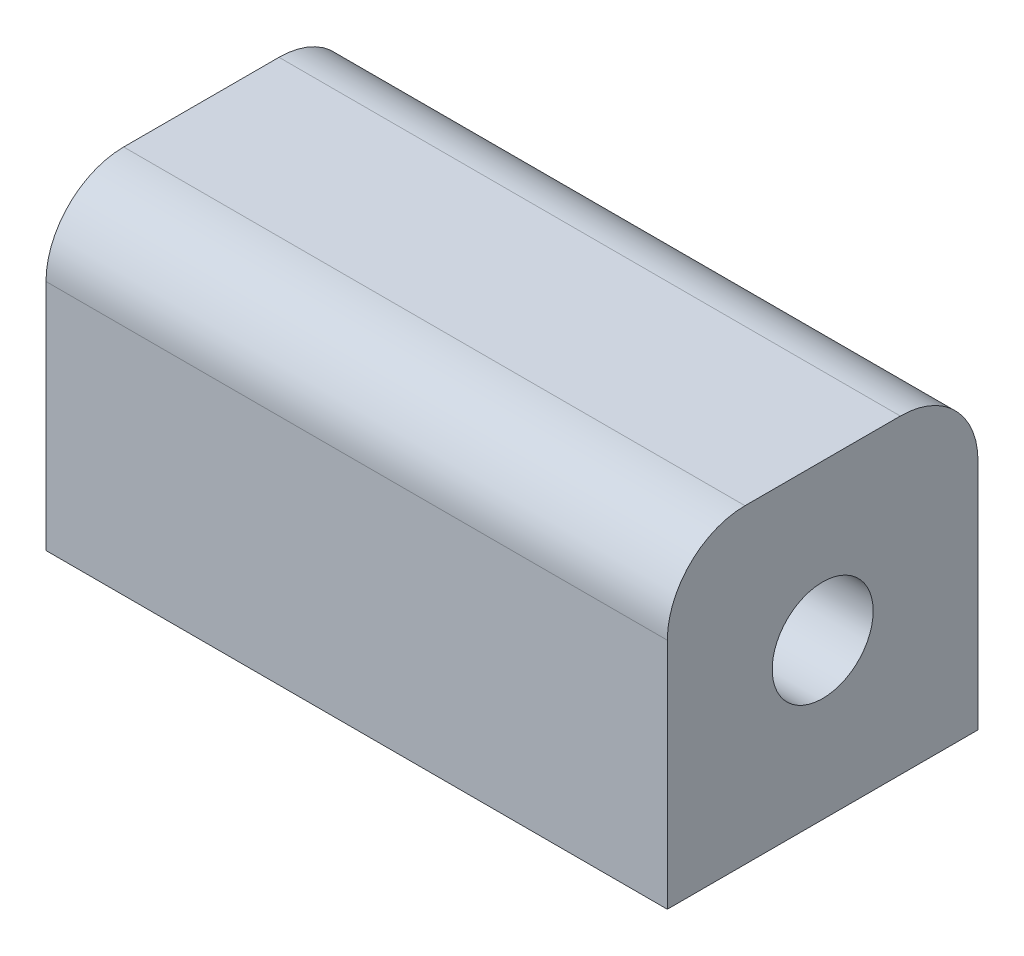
ISO-10303-21;
HEADER;
FILE_DESCRIPTION(('STEP AP214'),'2;1');
FILE_NAME('part.step','',(''),(''),'','','');
FILE_SCHEMA(('AUTOMOTIVE_DESIGN { 1 0 10303 214 1 1 1 1 }'));
ENDSEC;
DATA;
#1=APPLICATION_CONTEXT('core data for automotive mechanical design processes');
#2=APPLICATION_PROTOCOL_DEFINITION('international standard','automotive_design',2000,#1);
#3=PRODUCT_CONTEXT('',#1,'mechanical');
#4=PRODUCT('Part','Part','',(#3));
#5=PRODUCT_RELATED_PRODUCT_CATEGORY('part','',(#4));
#6=PRODUCT_DEFINITION_FORMATION('','',#4);
#7=PRODUCT_DEFINITION_CONTEXT('part definition',#1,'design');
#8=PRODUCT_DEFINITION('design','',#6,#7);
#9=PRODUCT_DEFINITION_SHAPE('','',#8);
#10=(LENGTH_UNIT() NAMED_UNIT(*) SI_UNIT(.MILLI.,.METRE.));
#11=(NAMED_UNIT(*) PLANE_ANGLE_UNIT() SI_UNIT($,.RADIAN.));
#12=(NAMED_UNIT(*) SI_UNIT($,.STERADIAN.) SOLID_ANGLE_UNIT());
#13=UNCERTAINTY_MEASURE_WITH_UNIT(LENGTH_MEASURE(1.E-05),#10,'distance_accuracy_value','');
#14=(GEOMETRIC_REPRESENTATION_CONTEXT(3) GLOBAL_UNCERTAINTY_ASSIGNED_CONTEXT((#13)) GLOBAL_UNIT_ASSIGNED_CONTEXT((#10,
#11,#12)) REPRESENTATION_CONTEXT('',''));
#15=CARTESIAN_POINT('',(0.,0.,0.));
#16=DIRECTION('',(0.,0.,1.));
#17=DIRECTION('',(1.,0.,0.));
#18=AXIS2_PLACEMENT_3D('',#15,#16,#17);
#19=CARTESIAN_POINT('',(0.,20.,0.));
#20=DIRECTION('',(1.,0.,0.));
#21=DIRECTION('',(0.,0.,-1.));
#22=AXIS2_PLACEMENT_3D('',#19,#20,#21);
#23=PLANE('',#22);
#24=CARTESIAN_POINT('',(0.,10.,-10.));
#25=DIRECTION('',(1.,0.,0.));
#26=DIRECTION('',(0.,0.,-1.));
#27=AXIS2_PLACEMENT_3D('',#24,#25,#26);
#28=CIRCLE('',#27,3.25);
#29=CARTESIAN_POINT('',(0.,10.,-13.25));
#30=VERTEX_POINT('',#29);
#31=EDGE_CURVE('E109',#30,#30,#28,.T.);
#32=ORIENTED_EDGE('',*,*,#31,.T.);
#33=EDGE_LOOP('',(#32));
#34=FACE_BOUND('',#33,.T.);
#35=DIRECTION('',(0.,0.,1.));
#36=VECTOR('',#35,1.);
#37=CARTESIAN_POINT('',(0.,20.,0.));
#38=LINE('',#37,#36);
#39=CARTESIAN_POINT('',(0.,20.,-15.));
#40=VERTEX_POINT('',#39);
#41=CARTESIAN_POINT('',(0.,20.,-5.));
#42=VERTEX_POINT('',#41);
#43=EDGE_CURVE('E121',#40,#42,#38,.T.);
#44=ORIENTED_EDGE('',*,*,#43,.F.);
#45=CARTESIAN_POINT('',(0.,15.,-15.));
#46=DIRECTION('',(1.,0.,0.));
#47=DIRECTION('',(0.,0.,-1.));
#48=AXIS2_PLACEMENT_3D('',#45,#46,#47);
#49=CIRCLE('',#48,5.);
#50=CARTESIAN_POINT('',(0.,15.,-20.));
#51=VERTEX_POINT('',#50);
#52=EDGE_CURVE('E188',#40,#51,#49,.F.);
#53=ORIENTED_EDGE('',*,*,#52,.T.);
#54=DIRECTION('',(0.,-1.,0.));
#55=VECTOR('',#54,1.);
#56=CARTESIAN_POINT('',(0.,20.,-20.));
#57=LINE('',#56,#55);
#58=CARTESIAN_POINT('',(0.,0.,-20.));
#59=VERTEX_POINT('',#58);
#60=EDGE_CURVE('E107',#51,#59,#57,.T.);
#61=ORIENTED_EDGE('',*,*,#60,.T.);
#62=DIRECTION('',(0.,0.,1.));
#63=VECTOR('',#62,1.);
#64=CARTESIAN_POINT('',(0.,0.,0.));
#65=LINE('',#64,#63);
#66=CARTESIAN_POINT('',(0.,0.,0.));
#67=VERTEX_POINT('',#66);
#68=EDGE_CURVE('E102',#59,#67,#65,.T.);
#69=ORIENTED_EDGE('',*,*,#68,.T.);
#70=DIRECTION('',(0.,-1.,0.));
#71=VECTOR('',#70,1.);
#72=CARTESIAN_POINT('',(0.,20.,0.));
#73=LINE('',#72,#71);
#74=CARTESIAN_POINT('',(0.,15.,0.));
#75=VERTEX_POINT('',#74);
#76=EDGE_CURVE('E86',#75,#67,#73,.T.);
#77=ORIENTED_EDGE('',*,*,#76,.F.);
#78=CARTESIAN_POINT('',(0.,15.,-5.));
#79=DIRECTION('',(1.,0.,0.));
#80=DIRECTION('',(0.,0.,-1.));
#81=AXIS2_PLACEMENT_3D('',#78,#79,#80);
#82=CIRCLE('',#81,5.);
#83=EDGE_CURVE('E189',#75,#42,#82,.F.);
#84=ORIENTED_EDGE('',*,*,#83,.T.);
#85=EDGE_LOOP('',(#44,#53,#61,#69,#77,#84));
#86=FACE_BOUND('',#85,.T.);
#87=ADVANCED_FACE('F33',(#34,#86),#23,.F.);
#88=CARTESIAN_POINT('',(0.,20.,0.));
#89=DIRECTION('',(0.,0.,-1.));
#90=DIRECTION('',(-1.,0.,0.));
#91=AXIS2_PLACEMENT_3D('',#88,#89,#90);
#92=PLANE('',#91);
#93=DIRECTION('',(0.,-1.,0.));
#94=VECTOR('',#93,1.);
#95=CARTESIAN_POINT('',(40.,20.,0.));
#96=LINE('',#95,#94);
#97=CARTESIAN_POINT('',(40.,15.,0.));
#98=VERTEX_POINT('',#97);
#99=CARTESIAN_POINT('',(40.,0.,0.));
#100=VERTEX_POINT('',#99);
#101=EDGE_CURVE('E96',#98,#100,#96,.T.);
#102=ORIENTED_EDGE('',*,*,#101,.F.);
#103=DIRECTION('',(1.,0.,0.));
#104=VECTOR('',#103,1.);
#105=CARTESIAN_POINT('',(0.,15.,0.));
#106=LINE('',#105,#104);
#107=EDGE_CURVE('E11',#98,#75,#106,.F.);
#108=ORIENTED_EDGE('',*,*,#107,.T.);
#109=ORIENTED_EDGE('',*,*,#76,.T.);
#110=DIRECTION('',(1.,0.,0.));
#111=VECTOR('',#110,1.);
#112=CARTESIAN_POINT('',(0.,0.,0.));
#113=LINE('',#112,#111);
#114=EDGE_CURVE('E89',#67,#100,#113,.T.);
#115=ORIENTED_EDGE('',*,*,#114,.T.);
#116=EDGE_LOOP('',(#102,#108,#109,#115));
#117=FACE_BOUND('',#116,.T.);
#118=ADVANCED_FACE('F88',(#117),#92,.F.);
#119=CARTESIAN_POINT('',(40.,20.,0.));
#120=DIRECTION('',(-1.,0.,0.));
#121=DIRECTION('',(0.,0.,1.));
#122=AXIS2_PLACEMENT_3D('',#119,#120,#121);
#123=PLANE('',#122);
#124=CARTESIAN_POINT('',(40.,10.,-10.));
#125=DIRECTION('',(1.,0.,0.));
#126=DIRECTION('',(0.,0.,-1.));
#127=AXIS2_PLACEMENT_3D('',#124,#125,#126);
#128=CIRCLE('',#127,3.25);
#129=CARTESIAN_POINT('',(40.,10.,-13.25));
#130=VERTEX_POINT('',#129);
#131=EDGE_CURVE('E112',#130,#130,#128,.T.);
#132=ORIENTED_EDGE('',*,*,#131,.F.);
#133=EDGE_LOOP('',(#132));
#134=FACE_BOUND('',#133,.T.);
#135=DIRECTION('',(0.,-1.,0.));
#136=VECTOR('',#135,1.);
#137=CARTESIAN_POINT('',(40.,20.,-20.));
#138=LINE('',#137,#136);
#139=CARTESIAN_POINT('',(40.,15.,-20.));
#140=VERTEX_POINT('',#139);
#141=CARTESIAN_POINT('',(40.,0.,-20.));
#142=VERTEX_POINT('',#141);
#143=EDGE_CURVE('E123',#140,#142,#138,.T.);
#144=ORIENTED_EDGE('',*,*,#143,.F.);
#145=CARTESIAN_POINT('',(40.,15.,-15.));
#146=DIRECTION('',(-1.,0.,0.));
#147=DIRECTION('',(0.,0.,1.));
#148=AXIS2_PLACEMENT_3D('',#145,#146,#147);
#149=CIRCLE('',#148,5.);
#150=CARTESIAN_POINT('',(40.,20.,-15.));
#151=VERTEX_POINT('',#150);
#152=EDGE_CURVE('E41',#140,#151,#149,.F.);
#153=ORIENTED_EDGE('',*,*,#152,.T.);
#154=DIRECTION('',(0.,0.,-1.));
#155=VECTOR('',#154,1.);
#156=CARTESIAN_POINT('',(40.,20.,0.));
#157=LINE('',#156,#155);
#158=CARTESIAN_POINT('',(40.,20.,-5.));
#159=VERTEX_POINT('',#158);
#160=EDGE_CURVE('E115',#159,#151,#157,.T.);
#161=ORIENTED_EDGE('',*,*,#160,.F.);
#162=CARTESIAN_POINT('',(40.,15.,-5.));
#163=DIRECTION('',(-1.,0.,0.));
#164=DIRECTION('',(0.,0.,1.));
#165=AXIS2_PLACEMENT_3D('',#162,#163,#164);
#166=CIRCLE('',#165,5.);
#167=EDGE_CURVE('E48',#159,#98,#166,.F.);
#168=ORIENTED_EDGE('',*,*,#167,.T.);
#169=ORIENTED_EDGE('',*,*,#101,.T.);
#170=DIRECTION('',(0.,0.,-1.));
#171=VECTOR('',#170,1.);
#172=CARTESIAN_POINT('',(40.,0.,0.));
#173=LINE('',#172,#171);
#174=EDGE_CURVE('E104',#100,#142,#173,.T.);
#175=ORIENTED_EDGE('',*,*,#174,.T.);
#176=EDGE_LOOP('',(#144,#153,#161,#168,#169,#175));
#177=FACE_BOUND('',#176,.T.);
#178=ADVANCED_FACE('F163',(#134,#177),#123,.F.);
#179=CARTESIAN_POINT('',(0.,20.,-20.));
#180=DIRECTION('',(0.,0.,1.));
#181=DIRECTION('',(1.,0.,0.));
#182=AXIS2_PLACEMENT_3D('',#179,#180,#181);
#183=PLANE('',#182);
#184=ORIENTED_EDGE('',*,*,#60,.F.);
#185=DIRECTION('',(-1.,0.,0.));
#186=VECTOR('',#185,1.);
#187=CARTESIAN_POINT('',(0.,15.,-20.));
#188=LINE('',#187,#186);
#189=EDGE_CURVE('E56',#51,#140,#188,.F.);
#190=ORIENTED_EDGE('',*,*,#189,.T.);
#191=ORIENTED_EDGE('',*,*,#143,.T.);
#192=DIRECTION('',(-1.,0.,0.));
#193=VECTOR('',#192,1.);
#194=CARTESIAN_POINT('',(0.,0.,-20.));
#195=LINE('',#194,#193);
#196=EDGE_CURVE('E119',#142,#59,#195,.T.);
#197=ORIENTED_EDGE('',*,*,#196,.T.);
#198=EDGE_LOOP('',(#184,#190,#191,#197));
#199=FACE_BOUND('',#198,.T.);
#200=ADVANCED_FACE('F168',(#199),#183,.F.);
#201=CARTESIAN_POINT('',(0.,20.,-20.));
#202=DIRECTION('',(0.,-1.,0.));
#203=DIRECTION('',(0.,0.,-1.));
#204=AXIS2_PLACEMENT_3D('',#201,#202,#203);
#205=PLANE('',#204);
#206=ORIENTED_EDGE('',*,*,#160,.T.);
#207=DIRECTION('',(-1.,0.,0.));
#208=VECTOR('',#207,1.);
#209=CARTESIAN_POINT('',(0.,20.,-15.));
#210=LINE('',#209,#208);
#211=EDGE_CURVE('E185',#151,#40,#210,.T.);
#212=ORIENTED_EDGE('',*,*,#211,.T.);
#213=ORIENTED_EDGE('',*,*,#43,.T.);
#214=DIRECTION('',(1.,0.,0.));
#215=VECTOR('',#214,1.);
#216=CARTESIAN_POINT('',(0.,20.,-5.));
#217=LINE('',#216,#215);
#218=EDGE_CURVE('E95',#42,#159,#217,.T.);
#219=ORIENTED_EDGE('',*,*,#218,.T.);
#220=EDGE_LOOP('',(#206,#212,#213,#219));
#221=FACE_BOUND('',#220,.T.);
#222=ADVANCED_FACE('F172',(#221),#205,.F.);
#223=CARTESIAN_POINT('',(0.,0.,-20.));
#224=DIRECTION('',(0.,-1.,0.));
#225=DIRECTION('',(0.,0.,-1.));
#226=AXIS2_PLACEMENT_3D('',#223,#224,#225);
#227=PLANE('',#226);
#228=CARTESIAN_POINT('',(10.,0.,-10.));
#229=DIRECTION('',(0.,-1.,0.));
#230=DIRECTION('',(0.,0.,-1.));
#231=AXIS2_PLACEMENT_3D('',#228,#229,#230);
#232=CIRCLE('',#231,1.5);
#233=CARTESIAN_POINT('',(10.,0.,-11.5));
#234=VERTEX_POINT('',#233);
#235=EDGE_CURVE('E201',#234,#234,#232,.T.);
#236=ORIENTED_EDGE('',*,*,#235,.F.);
#237=EDGE_LOOP('',(#236));
#238=FACE_BOUND('',#237,.T.);
#239=CARTESIAN_POINT('',(30.,0.,-10.));
#240=DIRECTION('',(0.,-1.,0.));
#241=DIRECTION('',(0.,0.,-1.));
#242=AXIS2_PLACEMENT_3D('',#239,#240,#241);
#243=CIRCLE('',#242,1.5);
#244=CARTESIAN_POINT('',(30.,0.,-11.5));
#245=VERTEX_POINT('',#244);
#246=EDGE_CURVE('E133',#245,#245,#243,.T.);
#247=ORIENTED_EDGE('',*,*,#246,.F.);
#248=EDGE_LOOP('',(#247));
#249=FACE_BOUND('',#248,.T.);
#250=ORIENTED_EDGE('',*,*,#68,.F.);
#251=ORIENTED_EDGE('',*,*,#196,.F.);
#252=ORIENTED_EDGE('',*,*,#174,.F.);
#253=ORIENTED_EDGE('',*,*,#114,.F.);
#254=EDGE_LOOP('',(#250,#251,#252,#253));
#255=FACE_BOUND('',#254,.T.);
#256=ADVANCED_FACE('F100',(#238,#249,#255),#227,.T.);
#257=CARTESIAN_POINT('',(0.,10.,-10.));
#258=DIRECTION('',(1.,0.,0.));
#259=DIRECTION('',(0.,0.,-1.));
#260=AXIS2_PLACEMENT_3D('',#257,#258,#259);
#261=CYLINDRICAL_SURFACE('',#260,3.25);
#262=CARTESIAN_POINT('',(10.,7.1168593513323,-11.5));
#263=CARTESIAN_POINT('',(10.0790560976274,7.1168542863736,-11.4999955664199));
#264=CARTESIAN_POINT('',(10.1582321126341,7.11355984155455,-11.4937096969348));
#265=CARTESIAN_POINT('',(10.3142248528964,7.10083600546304,-11.4688541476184));
#266=CARTESIAN_POINT('',(10.3910354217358,7.09139182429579,-11.4502548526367));
#267=CARTESIAN_POINT('',(10.5397553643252,7.0676860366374,-11.4016968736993));
#268=CARTESIAN_POINT('',(10.6116859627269,7.05344714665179,-11.3717916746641));
#269=CARTESIAN_POINT('',(10.7494914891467,7.0217909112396,-11.3016323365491));
#270=CARTESIAN_POINT('',(10.8153669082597,7.00437382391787,-11.2613790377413));
#271=CARTESIAN_POINT('',(10.9442826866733,6.96683285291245,-11.1683661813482));
#272=CARTESIAN_POINT('',(11.0068049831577,6.9466049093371,-11.1149302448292));
#273=CARTESIAN_POINT('',(11.1223938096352,6.90656765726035,-10.9984822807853));
#274=CARTESIAN_POINT('',(11.1754561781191,6.88675853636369,-10.9354660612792));
#275=CARTESIAN_POINT('',(11.2734806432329,6.84847607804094,-10.7973722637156));
#276=CARTESIAN_POINT('',(11.3178315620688,6.83013743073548,-10.7218200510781));
#277=CARTESIAN_POINT('',(11.3929625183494,6.79817483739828,-10.5633240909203));
#278=CARTESIAN_POINT('',(11.4237498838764,6.78454834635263,-10.4803843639));
#279=CARTESIAN_POINT('',(11.4689131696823,6.76428913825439,-10.3149336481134));
#280=CARTESIAN_POINT('',(11.4841902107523,6.75727436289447,-10.2327164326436));
#281=CARTESIAN_POINT('',(11.5008399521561,6.74962121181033,-10.0666076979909));
#282=CARTESIAN_POINT('',(11.5022196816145,6.74897961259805,-9.98271704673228));
#283=CARTESIAN_POINT('',(11.4914440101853,6.7539424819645,-9.82230837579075));
#284=CARTESIAN_POINT('',(11.4802875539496,6.75908599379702,-9.74570603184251));
#285=CARTESIAN_POINT('',(11.446507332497,6.77437487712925,-9.59560459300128));
#286=CARTESIAN_POINT('',(11.4238827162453,6.78452061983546,-9.52210572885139));
#287=CARTESIAN_POINT('',(11.3675879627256,6.80905225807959,-9.37894346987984));
#288=CARTESIAN_POINT('',(11.3337570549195,6.82349954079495,-9.30935424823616));
#289=CARTESIAN_POINT('',(11.2561940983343,6.85527850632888,-9.17665994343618));
#290=CARTESIAN_POINT('',(11.2124584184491,6.87261124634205,-9.11355725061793));
#291=CARTESIAN_POINT('',(11.1121036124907,6.91018883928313,-8.99001134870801));
#292=CARTESIAN_POINT('',(11.054713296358,6.93055600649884,-8.9302310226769));
#293=CARTESIAN_POINT('',(10.9307885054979,6.97090175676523,-8.82081753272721));
#294=CARTESIAN_POINT('',(10.8642488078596,6.99088011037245,-8.77119020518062));
#295=CARTESIAN_POINT('',(10.7199693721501,7.02917527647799,-8.68120934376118));
#296=CARTESIAN_POINT('',(10.6418464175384,7.04736710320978,-8.64141216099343));
#297=CARTESIAN_POINT('',(10.4789558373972,7.07843527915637,-8.57581901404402));
#298=CARTESIAN_POINT('',(10.3941942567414,7.09131639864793,-8.55001047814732));
#299=CARTESIAN_POINT('',(10.2270781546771,7.10903378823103,-8.51501701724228));
#300=CARTESIAN_POINT('',(10.145008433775,7.1143940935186,-8.50474482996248));
#301=CARTESIAN_POINT('',(9.98016038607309,7.11796624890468,-8.49786751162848));
#302=CARTESIAN_POINT('',(9.89738243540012,7.11618168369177,-8.50125552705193));
#303=CARTESIAN_POINT('',(9.74103868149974,7.10621551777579,-8.52060592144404));
#304=CARTESIAN_POINT('',(9.66729423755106,7.09859909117,-8.53545825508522));
#305=CARTESIAN_POINT('',(9.52344336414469,7.0786089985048,-8.57575404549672));
#306=CARTESIAN_POINT('',(9.45333793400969,7.06623403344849,-8.60120039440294));
#307=CARTESIAN_POINT('',(9.31514231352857,7.03744245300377,-8.66322455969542));
#308=CARTESIAN_POINT('',(9.24729111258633,7.0208668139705,-8.70025843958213));
#309=CARTESIAN_POINT('',(9.11839921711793,6.98572279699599,-8.78398483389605));
#310=CARTESIAN_POINT('',(9.05736187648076,6.96715344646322,-8.83068207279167));
#311=CARTESIAN_POINT('',(8.93720338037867,6.92778829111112,-8.93810874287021));
#312=CARTESIAN_POINT('',(8.87894171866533,6.90696178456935,-8.99979245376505));
#313=CARTESIAN_POINT('',(8.77338164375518,6.86715790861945,-9.1324777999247));
#314=CARTESIAN_POINT('',(8.72608534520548,6.84818089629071,-9.20348122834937));
#315=CARTESIAN_POINT('',(8.64336785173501,6.8138560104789,-9.3542203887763));
#316=CARTESIAN_POINT('',(8.60811091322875,6.79855911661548,-9.43405863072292));
#317=CARTESIAN_POINT('',(8.55184202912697,6.77369887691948,-9.59943594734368));
#318=CARTESIAN_POINT('',(8.530819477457,6.76413126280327,-9.6849707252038));
#319=CARTESIAN_POINT('',(8.50516273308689,6.75239744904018,-9.85172583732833));
#320=CARTESIAN_POINT('',(8.49932421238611,6.74968783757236,-9.93272343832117));
#321=CARTESIAN_POINT('',(8.50079987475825,6.75036943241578,-10.0945622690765));
#322=CARTESIAN_POINT('',(8.50811070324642,6.75375908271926,-10.1754035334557));
#323=CARTESIAN_POINT('',(8.53482963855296,6.7659476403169,-10.3303771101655));
#324=CARTESIAN_POINT('',(8.55360863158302,6.77446493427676,-10.4046421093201));
#325=CARTESIAN_POINT('',(8.6019630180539,6.79585601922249,-10.5488920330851));
#326=CARTESIAN_POINT('',(8.63154019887,6.80873053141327,-10.6188762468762));
#327=CARTESIAN_POINT('',(8.702114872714,6.83836514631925,-10.7561207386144));
#328=CARTESIAN_POINT('',(8.7435711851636,6.85527552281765,-10.8231117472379));
#329=CARTESIAN_POINT('',(8.83611548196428,6.89109220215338,-10.9494805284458));
#330=CARTESIAN_POINT('',(8.88720775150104,6.90999939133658,-11.0088548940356));
#331=CARTESIAN_POINT('',(9.00267061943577,6.94975682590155,-11.1236157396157));
#332=CARTESIAN_POINT('',(9.06780238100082,6.97063516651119,-11.1782291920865));
#333=CARTESIAN_POINT('',(9.20680487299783,7.01047954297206,-11.275954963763));
#334=CARTESIAN_POINT('',(9.28068155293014,7.0294442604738,-11.3190593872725));
#335=CARTESIAN_POINT('',(9.43637377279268,7.0632766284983,-11.3927764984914));
#336=CARTESIAN_POINT('',(9.51826799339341,7.07809670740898,-11.4232459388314));
#337=CARTESIAN_POINT('',(9.68683680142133,7.1010908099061,-11.4695281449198));
#338=CARTESIAN_POINT('',(9.77349429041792,7.10928713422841,-11.4853901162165));
#339=CARTESIAN_POINT('',(9.88400857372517,7.11462113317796,-11.4956902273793));
#340=CARTESIAN_POINT('',(9.90716599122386,7.11545838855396,-11.4973045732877));
#341=CARTESIAN_POINT('',(9.95354548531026,7.11657825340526,-11.4994601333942));
#342=CARTESIAN_POINT('',(9.97676756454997,7.11686083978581,-11.5000013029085));
#343=CARTESIAN_POINT('',(10.,7.1168593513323,-11.5));
#344=B_SPLINE_CURVE_WITH_KNOTS('',3,(#262,#263,#264,#265,#266,#267,#268,#269,#270,#271,#272,
#273,#274,#275,#276,#277,#278,#279,#280,#281,#282,#283,#284,#285,#286,#287,#288,#289,#290,#291,
#292,#293,#294,#295,#296,#297,#298,#299,#300,#301,#302,#303,#304,#305,#306,#307,#308,#309,#310,
#311,#312,#313,#314,#315,#316,#317,#318,#319,#320,#321,#322,#323,#324,#325,#326,#327,#328,#329,
#330,#331,#332,#333,#334,#335,#336,#337,#338,#339,#340,#341,#342,#343),.UNSPECIFIED.,.T.,.F.,(4,
2,2,2,2,2,2,2,2,2,2,2,2,2,2,2,2,2,2,2,2,2,2,2,2,2,2,2,2,2,2,2,2,2,2,2,2,2,2,2,4),(0.,
0.237070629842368,0.474713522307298,0.71124598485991,0.947759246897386,1.20076595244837,
1.45388368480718,1.72101627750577,1.98800436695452,2.23839767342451,2.48866432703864,
2.72031924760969,2.95199136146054,3.18714254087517,3.42238006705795,3.67727504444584,
3.93231613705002,4.1995422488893,4.46652780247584,4.71378889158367,4.96092594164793,
5.18674173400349,5.41261921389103,5.64883211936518,5.8851607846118,6.14606812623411,
6.40702574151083,6.67141336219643,6.93560376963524,7.17809302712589,7.42052043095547,
7.65071362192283,7.88094493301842,8.1216630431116,8.36248845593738,8.62387073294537,
8.88543187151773,9.14988229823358,9.41343862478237,9.48310433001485,9.55277293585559),.UNSPECIFIED.);
#345=CARTESIAN_POINT('',(10.,7.1168593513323,-11.5));
#346=VERTEX_POINT('',#345);
#347=EDGE_CURVE('E134',#346,#346,#344,.T.);
#348=ORIENTED_EDGE('',*,*,#347,.T.);
#349=EDGE_LOOP('',(#348));
#350=FACE_BOUND('',#349,.T.);
#351=CARTESIAN_POINT('',(30.,7.1168593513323,-11.5));
#352=CARTESIAN_POINT('',(30.0790560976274,7.1168542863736,-11.4999955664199));
#353=CARTESIAN_POINT('',(30.1582321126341,7.11355984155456,-11.4937096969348));
#354=CARTESIAN_POINT('',(30.3142248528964,7.10083600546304,-11.4688541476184));
#355=CARTESIAN_POINT('',(30.3910354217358,7.09139182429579,-11.4502548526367));
#356=CARTESIAN_POINT('',(30.5397553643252,7.06768603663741,-11.4016968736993));
#357=CARTESIAN_POINT('',(30.6116859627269,7.05344714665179,-11.3717916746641));
#358=CARTESIAN_POINT('',(30.7494914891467,7.0217909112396,-11.3016323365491));
#359=CARTESIAN_POINT('',(30.8153669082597,7.00437382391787,-11.2613790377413));
#360=CARTESIAN_POINT('',(30.9442826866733,6.96683285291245,-11.1683661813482));
#361=CARTESIAN_POINT('',(31.0068049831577,6.9466049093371,-11.1149302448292));
#362=CARTESIAN_POINT('',(31.1223938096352,6.90656765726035,-10.9984822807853));
#363=CARTESIAN_POINT('',(31.1754561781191,6.88675853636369,-10.9354660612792));
#364=CARTESIAN_POINT('',(31.2734806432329,6.84847607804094,-10.7973722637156));
#365=CARTESIAN_POINT('',(31.3178315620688,6.83013743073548,-10.7218200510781));
#366=CARTESIAN_POINT('',(31.3929625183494,6.79817483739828,-10.5633240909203));
#367=CARTESIAN_POINT('',(31.4237498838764,6.78454834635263,-10.4803843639));
#368=CARTESIAN_POINT('',(31.4689131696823,6.76428913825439,-10.3149336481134));
#369=CARTESIAN_POINT('',(31.4841902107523,6.75727436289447,-10.2327164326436));
#370=CARTESIAN_POINT('',(31.5008399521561,6.74962121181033,-10.0666076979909));
#371=CARTESIAN_POINT('',(31.5022196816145,6.74897961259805,-9.98271704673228));
#372=CARTESIAN_POINT('',(31.4914440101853,6.7539424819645,-9.82230837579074));
#373=CARTESIAN_POINT('',(31.4802875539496,6.75908599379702,-9.74570603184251));
#374=CARTESIAN_POINT('',(31.446507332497,6.77437487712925,-9.59560459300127));
#375=CARTESIAN_POINT('',(31.4238827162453,6.78452061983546,-9.52210572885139));
#376=CARTESIAN_POINT('',(31.3675879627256,6.80905225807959,-9.37894346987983));
#377=CARTESIAN_POINT('',(31.3337570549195,6.82349954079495,-9.30935424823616));
#378=CARTESIAN_POINT('',(31.2561940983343,6.85527850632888,-9.17665994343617));
#379=CARTESIAN_POINT('',(31.2124584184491,6.87261124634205,-9.11355725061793));
#380=CARTESIAN_POINT('',(31.1121036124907,6.91018883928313,-8.99001134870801));
#381=CARTESIAN_POINT('',(31.054713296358,6.93055600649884,-8.9302310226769));
#382=CARTESIAN_POINT('',(30.9307885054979,6.97090175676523,-8.8208175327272));
#383=CARTESIAN_POINT('',(30.8642488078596,6.99088011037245,-8.77119020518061));
#384=CARTESIAN_POINT('',(30.7199693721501,7.029175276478,-8.68120934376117));
#385=CARTESIAN_POINT('',(30.6418464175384,7.04736710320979,-8.64141216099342));
#386=CARTESIAN_POINT('',(30.4789558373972,7.07843527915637,-8.57581901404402));
#387=CARTESIAN_POINT('',(30.3941942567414,7.09131639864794,-8.55001047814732));
#388=CARTESIAN_POINT('',(30.2270781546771,7.10903378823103,-8.51501701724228));
#389=CARTESIAN_POINT('',(30.145008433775,7.1143940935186,-8.50474482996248));
#390=CARTESIAN_POINT('',(29.9801603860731,7.11796624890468,-8.49786751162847));
#391=CARTESIAN_POINT('',(29.8973824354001,7.11618168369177,-8.50125552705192));
#392=CARTESIAN_POINT('',(29.7410386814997,7.10621551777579,-8.52060592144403));
#393=CARTESIAN_POINT('',(29.6672942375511,7.09859909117,-8.53545825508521));
#394=CARTESIAN_POINT('',(29.5234433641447,7.0786089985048,-8.57575404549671));
#395=CARTESIAN_POINT('',(29.4533379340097,7.06623403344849,-8.60120039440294));
#396=CARTESIAN_POINT('',(29.3151423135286,7.03744245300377,-8.66322455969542));
#397=CARTESIAN_POINT('',(29.2472911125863,7.0208668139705,-8.70025843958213));
#398=CARTESIAN_POINT('',(29.1183992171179,6.98572279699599,-8.78398483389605));
#399=CARTESIAN_POINT('',(29.0573618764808,6.96715344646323,-8.83068207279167));
#400=CARTESIAN_POINT('',(28.9372033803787,6.92778829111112,-8.93810874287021));
#401=CARTESIAN_POINT('',(28.8789417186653,6.90696178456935,-8.99979245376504));
#402=CARTESIAN_POINT('',(28.7733816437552,6.86715790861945,-9.13247779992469));
#403=CARTESIAN_POINT('',(28.7260853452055,6.84818089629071,-9.20348122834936));
#404=CARTESIAN_POINT('',(28.643367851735,6.81385601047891,-9.3542203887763));
#405=CARTESIAN_POINT('',(28.6081109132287,6.79855911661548,-9.43405863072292));
#406=CARTESIAN_POINT('',(28.551842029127,6.77369887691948,-9.59943594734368));
#407=CARTESIAN_POINT('',(28.530819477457,6.76413126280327,-9.6849707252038));
#408=CARTESIAN_POINT('',(28.5051627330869,6.75239744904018,-9.85172583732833));
#409=CARTESIAN_POINT('',(28.4993242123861,6.74968783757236,-9.93272343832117));
#410=CARTESIAN_POINT('',(28.5007998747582,6.75036943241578,-10.0945622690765));
#411=CARTESIAN_POINT('',(28.5081107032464,6.75375908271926,-10.1754035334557));
#412=CARTESIAN_POINT('',(28.534829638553,6.7659476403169,-10.3303771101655));
#413=CARTESIAN_POINT('',(28.553608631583,6.77446493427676,-10.4046421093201));
#414=CARTESIAN_POINT('',(28.6019630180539,6.79585601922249,-10.5488920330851));
#415=CARTESIAN_POINT('',(28.63154019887,6.80873053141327,-10.6188762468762));
#416=CARTESIAN_POINT('',(28.702114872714,6.83836514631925,-10.7561207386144));
#417=CARTESIAN_POINT('',(28.7435711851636,6.85527552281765,-10.8231117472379));
#418=CARTESIAN_POINT('',(28.8361154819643,6.89109220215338,-10.9494805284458));
#419=CARTESIAN_POINT('',(28.887207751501,6.90999939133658,-11.0088548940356));
#420=CARTESIAN_POINT('',(29.0026706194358,6.94975682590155,-11.1236157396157));
#421=CARTESIAN_POINT('',(29.0678023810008,6.97063516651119,-11.1782291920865));
#422=CARTESIAN_POINT('',(29.2068048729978,7.01047954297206,-11.275954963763));
#423=CARTESIAN_POINT('',(29.2806815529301,7.0294442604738,-11.3190593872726));
#424=CARTESIAN_POINT('',(29.4363737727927,7.0632766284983,-11.3927764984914));
#425=CARTESIAN_POINT('',(29.5182679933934,7.07809670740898,-11.4232459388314));
#426=CARTESIAN_POINT('',(29.6868368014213,7.1010908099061,-11.4695281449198));
#427=CARTESIAN_POINT('',(29.7734942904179,7.10928713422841,-11.4853901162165));
#428=CARTESIAN_POINT('',(29.8840085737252,7.11462113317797,-11.4956902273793));
#429=CARTESIAN_POINT('',(29.9071659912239,7.11545838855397,-11.4973045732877));
#430=CARTESIAN_POINT('',(29.9535454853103,7.11657825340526,-11.4994601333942));
#431=CARTESIAN_POINT('',(29.97676756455,7.11686083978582,-11.5000013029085));
#432=CARTESIAN_POINT('',(30.,7.1168593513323,-11.5));
#433=B_SPLINE_CURVE_WITH_KNOTS('',3,(#351,#352,#353,#354,#355,#356,#357,#358,#359,#360,#361,
#362,#363,#364,#365,#366,#367,#368,#369,#370,#371,#372,#373,#374,#375,#376,#377,#378,#379,#380,
#381,#382,#383,#384,#385,#386,#387,#388,#389,#390,#391,#392,#393,#394,#395,#396,#397,#398,#399,
#400,#401,#402,#403,#404,#405,#406,#407,#408,#409,#410,#411,#412,#413,#414,#415,#416,#417,#418,
#419,#420,#421,#422,#423,#424,#425,#426,#427,#428,#429,#430,#431,#432),.UNSPECIFIED.,.T.,.F.,(4,
2,2,2,2,2,2,2,2,2,2,2,2,2,2,2,2,2,2,2,2,2,2,2,2,2,2,2,2,2,2,2,2,2,2,2,2,2,2,2,4),(0.,
0.237070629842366,0.474713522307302,0.711245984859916,0.94775924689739,1.20076595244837,
1.45388368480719,1.72101627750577,1.98800436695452,2.23839767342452,2.48866432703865,
2.72031924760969,2.95199136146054,3.18714254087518,3.42238006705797,3.67727504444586,
3.93231613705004,4.19954224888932,4.46652780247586,4.71378889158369,4.96092594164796,
5.18674173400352,5.41261921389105,5.64883211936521,5.88516078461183,6.14606812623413,
6.40702574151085,6.67141336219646,6.93560376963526,7.17809302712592,7.4205204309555,
7.65071362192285,7.88094493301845,8.12166304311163,8.36248845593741,8.6238707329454,
8.88543187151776,9.14988229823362,9.41343862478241,9.48310433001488,9.55277293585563),.UNSPECIFIED.);
#434=CARTESIAN_POINT('',(30.,7.1168593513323,-11.5));
#435=VERTEX_POINT('',#434);
#436=EDGE_CURVE('E126',#435,#435,#433,.T.);
#437=ORIENTED_EDGE('',*,*,#436,.T.);
#438=EDGE_LOOP('',(#437));
#439=FACE_BOUND('',#438,.T.);
#440=ORIENTED_EDGE('',*,*,#31,.F.);
#441=EDGE_LOOP('',(#440));
#442=FACE_BOUND('',#441,.T.);
#443=ORIENTED_EDGE('',*,*,#131,.T.);
#444=EDGE_LOOP('',(#443));
#445=FACE_BOUND('',#444,.T.);
#446=ADVANCED_FACE('F139',(#350,#439,#442,#445),#261,.F.);
#447=CARTESIAN_POINT('',(30.,10.,-10.));
#448=DIRECTION('',(0.,-1.,0.));
#449=DIRECTION('',(0.,0.,-1.));
#450=AXIS2_PLACEMENT_3D('',#447,#448,#449);
#451=CYLINDRICAL_SURFACE('',#450,1.5);
#452=ORIENTED_EDGE('',*,*,#246,.T.);
#453=EDGE_LOOP('',(#452));
#454=FACE_BOUND('',#453,.T.);
#455=ORIENTED_EDGE('',*,*,#436,.F.);
#456=EDGE_LOOP('',(#455));
#457=FACE_BOUND('',#456,.T.);
#458=ADVANCED_FACE('F142',(#454,#457),#451,.F.);
#459=CARTESIAN_POINT('',(10.,10.,-10.));
#460=DIRECTION('',(0.,-1.,0.));
#461=DIRECTION('',(0.,0.,-1.));
#462=AXIS2_PLACEMENT_3D('',#459,#460,#461);
#463=CYLINDRICAL_SURFACE('',#462,1.5);
#464=ORIENTED_EDGE('',*,*,#235,.T.);
#465=EDGE_LOOP('',(#464));
#466=FACE_BOUND('',#465,.T.);
#467=ORIENTED_EDGE('',*,*,#347,.F.);
#468=EDGE_LOOP('',(#467));
#469=FACE_BOUND('',#468,.T.);
#470=ADVANCED_FACE('F145',(#466,#469),#463,.F.);
#471=CARTESIAN_POINT('',(0.,15.,-15.));
#472=DIRECTION('',(-1.,0.,0.));
#473=DIRECTION('',(0.,0.,1.));
#474=AXIS2_PLACEMENT_3D('',#471,#472,#473);
#475=CYLINDRICAL_SURFACE('',#474,5.);
#476=ORIENTED_EDGE('',*,*,#152,.F.);
#477=ORIENTED_EDGE('',*,*,#189,.F.);
#478=ORIENTED_EDGE('',*,*,#52,.F.);
#479=ORIENTED_EDGE('',*,*,#211,.F.);
#480=EDGE_LOOP('',(#476,#477,#478,#479));
#481=FACE_BOUND('',#480,.T.);
#482=ADVANCED_FACE('F149',(#481),#475,.T.);
#483=CARTESIAN_POINT('',(0.,15.,-5.));
#484=DIRECTION('',(1.,0.,0.));
#485=DIRECTION('',(0.,0.,-1.));
#486=AXIS2_PLACEMENT_3D('',#483,#484,#485);
#487=CYLINDRICAL_SURFACE('',#486,5.);
#488=ORIENTED_EDGE('',*,*,#83,.F.);
#489=ORIENTED_EDGE('',*,*,#107,.F.);
#490=ORIENTED_EDGE('',*,*,#167,.F.);
#491=ORIENTED_EDGE('',*,*,#218,.F.);
#492=EDGE_LOOP('',(#488,#489,#490,#491));
#493=FACE_BOUND('',#492,.T.);
#494=ADVANCED_FACE('F35',(#493),#487,.T.);
#495=CLOSED_SHELL('',(#87,#118,#178,#200,#222,#256,#446,#458,#470,#482,#494));
#496=MANIFOLD_SOLID_BREP('B2',#495);
#497=ADVANCED_BREP_SHAPE_REPRESENTATION('',(#18,#496),#14);
#498=SHAPE_DEFINITION_REPRESENTATION(#9,#497);
ENDSEC;
END-ISO-10303-21;
